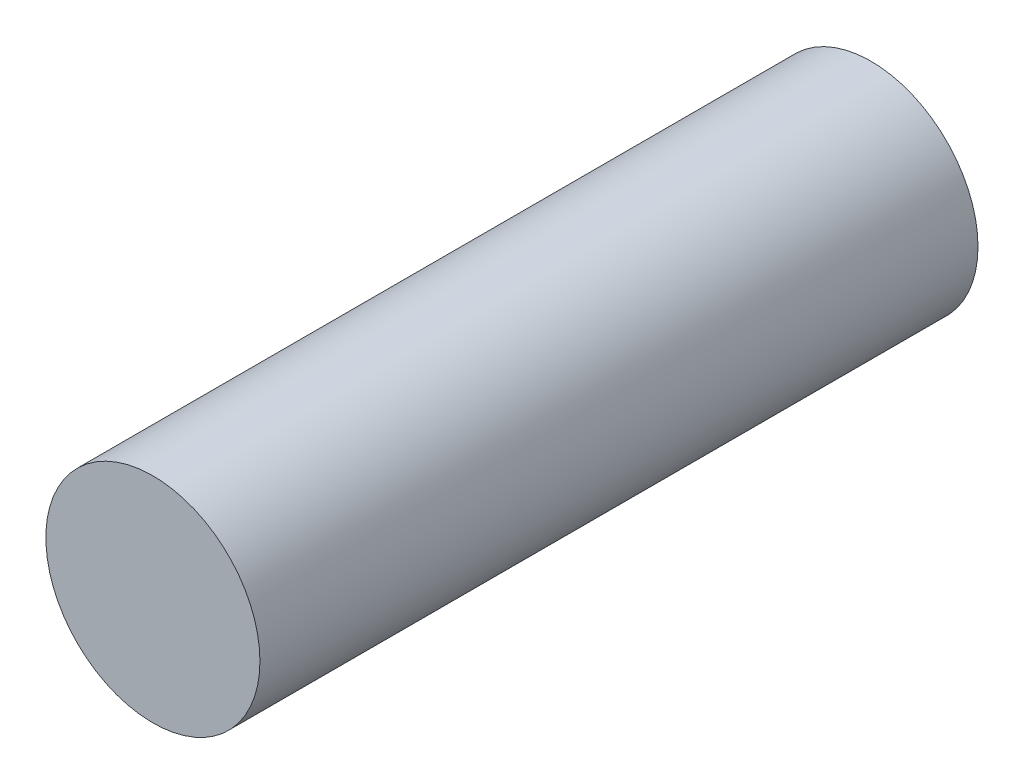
from build123d import *

# Parameters (mm, degrees)
SKETCH1_R           = 10.45
BOSS_EXTRUDE1_DEPTH = 70.1


with BuildPart() as part:
    # Sketch1 → Boss-Extrude1 (new body)
    with BuildSketch(Plane.XY):
        Circle(SKETCH1_R)
    extrude(amount=BOSS_EXTRUDE1_DEPTH)


solid = part.part
